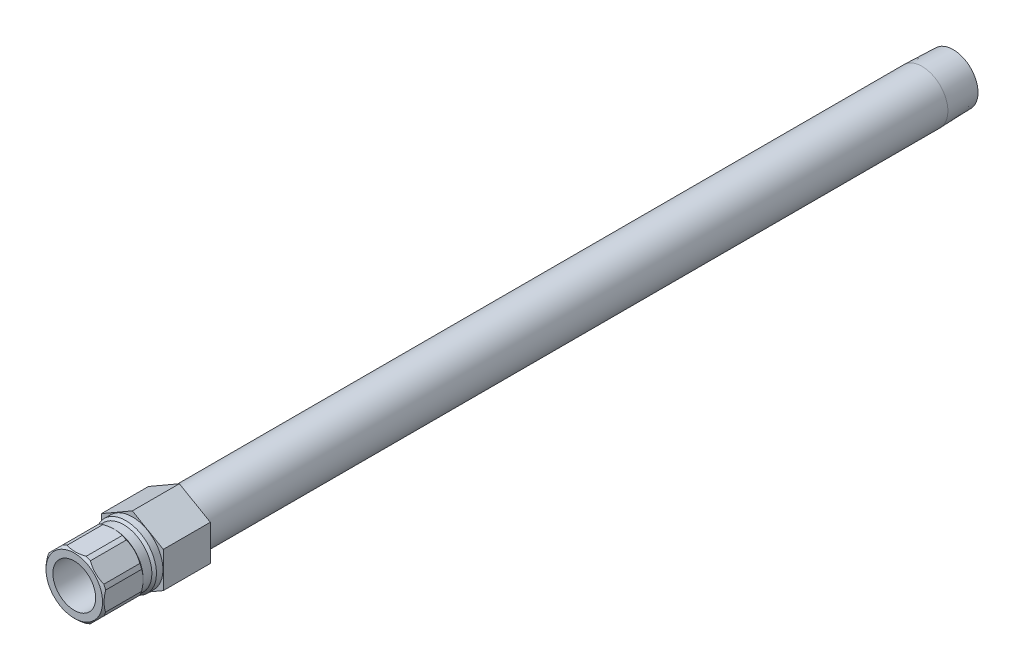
from build123d import *

# Parameters (mm, degrees)
SKETCH2_R           = 6.2611
BOSS_EXTRUDE1_DEPTH = 15.621
CUT_EXTRUDE1_START  = 5.8166
SKETCH3_OUTSIDE_W   = 81.332
SKETCH3_OUTSIDE_H   = 84.514
CUT_EXTRUDE1_DEPTH  = 268.431595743


with BuildPart() as part:
    # Sketch1 → Revolve1 (revolve)
    with BuildSketch(Plane(origin=(0, 0, 0), x_dir=(0, 0, -1), z_dir=(1, 0, 0))):
        Polygon((-19.304, 7.112), (-19.304, 9.398), (-18.542, 10.16), (-6.5786, 10.16), (-5.8166, 9.398), (-2.921, 9.398), (-2.159, 10.16), (0, 10.16), (0, 8.5725), (262.4582, 8.5725), (272.796, 8.249445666), (272.796, 6.2611), (-0.6731, 6.2611), (-1.524, 7.112), align=None)
    revolve(axis=Axis((0, 0, 0), (0, 0, 1)))

    # Sketch2 → Boss-Extrude1 (add)
    with BuildSketch(Plane.XY):
        Polygon((-10.287, 5.939202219), (-10.287, -5.939202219), (0, -11.878404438), (10.287, -5.939202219), (10.287, 5.939202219), (0, 11.878404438), align=None)
        with Locations(Location((0, 0, 0), (0, 0, 90))):
            Circle(SKETCH2_R, mode=Mode.SUBTRACT)
    extrude(amount=-BOSS_EXTRUDE1_DEPTH)

    # Sketch3 outside → Cut-Extrude1 (cut, through all)
    with BuildSketch(Plane.XY.offset(CUT_EXTRUDE1_START)):
        Rectangle(SKETCH3_OUTSIDE_W, SKETCH3_OUTSIDE_H)
        Polygon((9.652, -3.997989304), (9.652, 3.997989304), (3.997989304, 9.652), (-3.997989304, 9.652), (-9.652, 3.997989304), (-9.652, -3.997989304), (-3.997989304, -9.652), (3.997989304, -9.652), align=None, mode=Mode.SUBTRACT)
    extrude(amount=CUT_EXTRUDE1_DEPTH, mode=Mode.SUBTRACT)


solid = part.part
